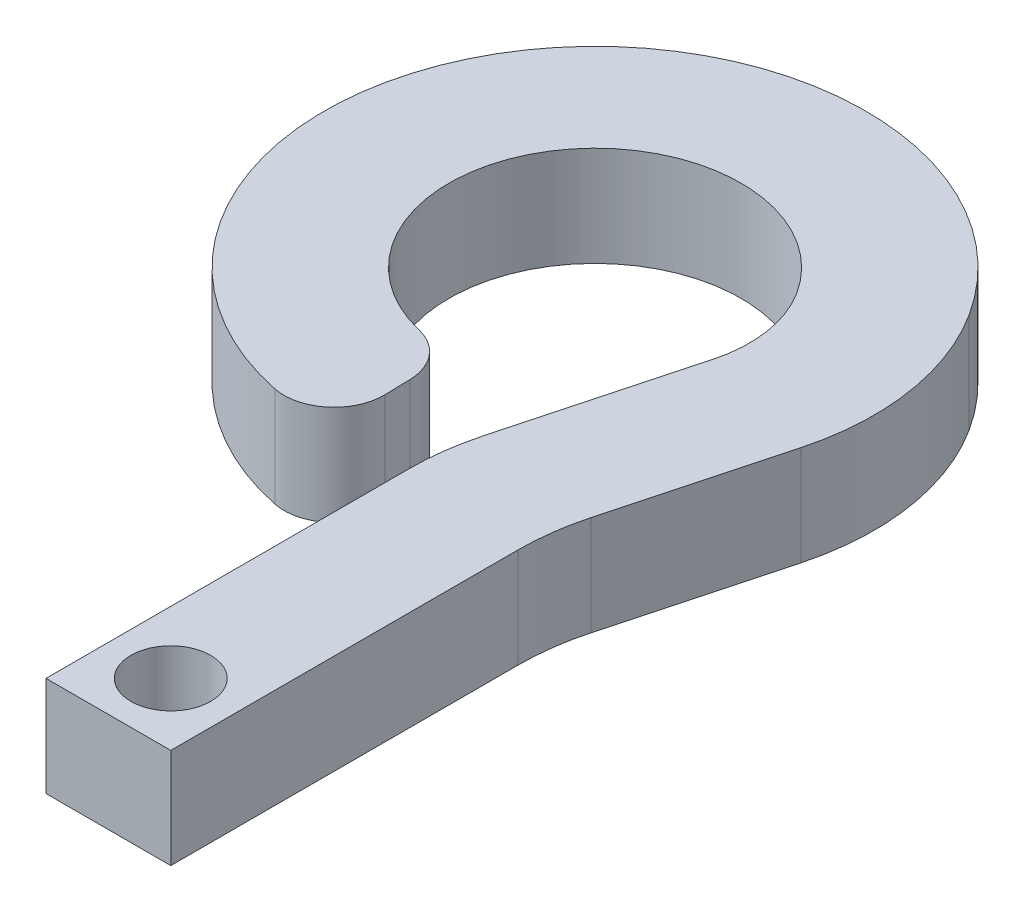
ISO-10303-21;
HEADER;
FILE_DESCRIPTION(('STEP AP214'),'2;1');
FILE_NAME('part.step','',(''),(''),'','','');
FILE_SCHEMA(('AUTOMOTIVE_DESIGN { 1 0 10303 214 1 1 1 1 }'));
ENDSEC;
DATA;
#1=APPLICATION_CONTEXT('core data for automotive mechanical design processes');
#2=APPLICATION_PROTOCOL_DEFINITION('international standard','automotive_design',2000,#1);
#3=PRODUCT_CONTEXT('',#1,'mechanical');
#4=PRODUCT('Part','Part','',(#3));
#5=PRODUCT_RELATED_PRODUCT_CATEGORY('part','',(#4));
#6=PRODUCT_DEFINITION_FORMATION('','',#4);
#7=PRODUCT_DEFINITION_CONTEXT('part definition',#1,'design');
#8=PRODUCT_DEFINITION('design','',#6,#7);
#9=PRODUCT_DEFINITION_SHAPE('','',#8);
#10=(LENGTH_UNIT() NAMED_UNIT(*) SI_UNIT(.MILLI.,.METRE.));
#11=(NAMED_UNIT(*) PLANE_ANGLE_UNIT() SI_UNIT($,.RADIAN.));
#12=(NAMED_UNIT(*) SI_UNIT($,.STERADIAN.) SOLID_ANGLE_UNIT());
#13=UNCERTAINTY_MEASURE_WITH_UNIT(LENGTH_MEASURE(1.E-05),#10,'distance_accuracy_value','');
#14=(GEOMETRIC_REPRESENTATION_CONTEXT(3) GLOBAL_UNCERTAINTY_ASSIGNED_CONTEXT((#13)) GLOBAL_UNIT_ASSIGNED_CONTEXT((#10,
#11,#12)) REPRESENTATION_CONTEXT('',''));
#15=CARTESIAN_POINT('',(0.,0.,0.));
#16=DIRECTION('',(0.,0.,1.));
#17=DIRECTION('',(1.,0.,0.));
#18=AXIS2_PLACEMENT_3D('',#15,#16,#17);
#19=CARTESIAN_POINT('',(0.,-4.,0.));
#20=DIRECTION('',(1.,0.,0.));
#21=DIRECTION('',(0.,0.,-1.));
#22=AXIS2_PLACEMENT_3D('',#19,#20,#21);
#23=PLANE('',#22);
#24=DIRECTION('',(0.,0.,-1.));
#25=VECTOR('',#24,1.);
#26=CARTESIAN_POINT('',(0.,0.,0.));
#27=LINE('',#26,#25);
#28=CARTESIAN_POINT('',(0.,0.,0.));
#29=VERTEX_POINT('',#28);
#30=CARTESIAN_POINT('',(0.,0.,-13.908964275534));
#31=VERTEX_POINT('',#30);
#32=EDGE_CURVE('E184',#29,#31,#27,.T.);
#33=ORIENTED_EDGE('',*,*,#32,.F.);
#34=DIRECTION('',(0.,1.,0.));
#35=VECTOR('',#34,1.);
#36=CARTESIAN_POINT('',(0.,-4.,0.));
#37=LINE('',#36,#35);
#38=CARTESIAN_POINT('',(0.,-4.,0.));
#39=VERTEX_POINT('',#38);
#40=EDGE_CURVE('E156',#39,#29,#37,.T.);
#41=ORIENTED_EDGE('',*,*,#40,.F.);
#42=DIRECTION('',(0.,0.,-1.));
#43=VECTOR('',#42,1.);
#44=CARTESIAN_POINT('',(0.,-4.,0.));
#45=LINE('',#44,#43);
#46=CARTESIAN_POINT('',(0.,-4.,-13.908964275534));
#47=VERTEX_POINT('',#46);
#48=EDGE_CURVE('E151',#39,#47,#45,.T.);
#49=ORIENTED_EDGE('',*,*,#48,.T.);
#50=DIRECTION('',(0.,1.,0.));
#51=VECTOR('',#50,1.);
#52=CARTESIAN_POINT('',(0.,-4.,-13.908964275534));
#53=LINE('',#52,#51);
#54=EDGE_CURVE('E133',#47,#31,#53,.T.);
#55=ORIENTED_EDGE('',*,*,#54,.T.);
#56=EDGE_LOOP('',(#33,#41,#49,#55));
#57=FACE_BOUND('',#56,.T.);
#58=ADVANCED_FACE('F34',(#57),#23,.T.);
#59=CARTESIAN_POINT('',(0.,-4.,0.));
#60=DIRECTION('',(0.,0.,1.));
#61=DIRECTION('',(1.,0.,0.));
#62=AXIS2_PLACEMENT_3D('',#59,#60,#61);
#63=PLANE('',#62);
#64=DIRECTION('',(1.,0.,0.));
#65=VECTOR('',#64,1.);
#66=CARTESIAN_POINT('',(0.,0.,0.));
#67=LINE('',#66,#65);
#68=CARTESIAN_POINT('',(-5.,0.,0.));
#69=VERTEX_POINT('',#68);
#70=EDGE_CURVE('E157',#69,#29,#67,.T.);
#71=ORIENTED_EDGE('',*,*,#70,.F.);
#72=DIRECTION('',(0.,1.,0.));
#73=VECTOR('',#72,1.);
#74=CARTESIAN_POINT('',(-5.,-4.,0.));
#75=LINE('',#74,#73);
#76=CARTESIAN_POINT('',(-5.,-4.,0.));
#77=VERTEX_POINT('',#76);
#78=EDGE_CURVE('E206',#77,#69,#75,.T.);
#79=ORIENTED_EDGE('',*,*,#78,.F.);
#80=DIRECTION('',(1.,0.,0.));
#81=VECTOR('',#80,1.);
#82=CARTESIAN_POINT('',(0.,-4.,0.));
#83=LINE('',#82,#81);
#84=EDGE_CURVE('E144',#77,#39,#83,.T.);
#85=ORIENTED_EDGE('',*,*,#84,.T.);
#86=ORIENTED_EDGE('',*,*,#40,.T.);
#87=EDGE_LOOP('',(#71,#79,#85,#86));
#88=FACE_BOUND('',#87,.T.);
#89=ADVANCED_FACE('F254',(#88),#63,.T.);
#90=CARTESIAN_POINT('',(-5.,-4.,0.));
#91=DIRECTION('',(-1.,0.,0.));
#92=DIRECTION('',(0.,0.,1.));
#93=AXIS2_PLACEMENT_3D('',#90,#91,#92);
#94=PLANE('',#93);
#95=DIRECTION('',(0.,0.,1.));
#96=VECTOR('',#95,1.);
#97=CARTESIAN_POINT('',(-5.,0.,0.));
#98=LINE('',#97,#96);
#99=CARTESIAN_POINT('',(-5.,0.,-14.567226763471));
#100=VERTEX_POINT('',#99);
#101=EDGE_CURVE('E160',#100,#69,#98,.T.);
#102=ORIENTED_EDGE('',*,*,#101,.F.);
#103=DIRECTION('',(0.,1.,0.));
#104=VECTOR('',#103,1.);
#105=CARTESIAN_POINT('',(-5.,-4.,-14.567226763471));
#106=LINE('',#105,#104);
#107=CARTESIAN_POINT('',(-5.,-4.,-14.567226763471));
#108=VERTEX_POINT('',#107);
#109=EDGE_CURVE('E208',#108,#100,#106,.T.);
#110=ORIENTED_EDGE('',*,*,#109,.F.);
#111=DIRECTION('',(0.,0.,1.));
#112=VECTOR('',#111,1.);
#113=CARTESIAN_POINT('',(-5.,-4.,0.));
#114=LINE('',#113,#112);
#115=EDGE_CURVE('E180',#108,#77,#114,.T.);
#116=ORIENTED_EDGE('',*,*,#115,.T.);
#117=ORIENTED_EDGE('',*,*,#78,.T.);
#118=EDGE_LOOP('',(#102,#110,#116,#117));
#119=FACE_BOUND('',#118,.T.);
#120=ADVANCED_FACE('F304',(#119),#94,.T.);
#121=CARTESIAN_POINT('',(5.,-4.,-14.567226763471));
#122=DIRECTION('',(0.,1.,0.));
#123=DIRECTION('',(0.,0.,1.));
#124=AXIS2_PLACEMENT_3D('',#121,#122,#123);
#125=CYLINDRICAL_SURFACE('',#124,10.);
#126=CARTESIAN_POINT('',(5.,0.,-14.567226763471));
#127=DIRECTION('',(0.,1.,0.));
#128=DIRECTION('',(0.,0.,-1.));
#129=AXIS2_PLACEMENT_3D('',#126,#127,#128);
#130=CIRCLE('',#129,10.);
#131=CARTESIAN_POINT('',(-4.65925826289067,0.,-17.1554172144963));
#132=VERTEX_POINT('',#131);
#133=EDGE_CURVE('E199',#132,#100,#130,.T.);
#134=ORIENTED_EDGE('',*,*,#133,.F.);
#135=DIRECTION('',(0.,1.,0.));
#136=VECTOR('',#135,1.);
#137=CARTESIAN_POINT('',(-4.65925826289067,-4.,-17.1554172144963));
#138=LINE('',#137,#136);
#139=CARTESIAN_POINT('',(-4.65925826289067,-4.,-17.1554172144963));
#140=VERTEX_POINT('',#139);
#141=EDGE_CURVE('E210',#140,#132,#138,.T.);
#142=ORIENTED_EDGE('',*,*,#141,.F.);
#143=CARTESIAN_POINT('',(5.,-4.,-14.567226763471));
#144=DIRECTION('',(0.,1.,0.));
#145=DIRECTION('',(0.,0.,-1.));
#146=AXIS2_PLACEMENT_3D('',#143,#144,#145);
#147=CIRCLE('',#146,10.);
#148=EDGE_CURVE('E177',#140,#108,#147,.T.);
#149=ORIENTED_EDGE('',*,*,#148,.T.);
#150=ORIENTED_EDGE('',*,*,#109,.T.);
#151=EDGE_LOOP('',(#134,#142,#149,#150));
#152=FACE_BOUND('',#151,.T.);
#153=ADVANCED_FACE('F262',(#152),#125,.T.);
#154=CARTESIAN_POINT('',(-4.65925826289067,-4.,-17.1554172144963));
#155=DIRECTION('',(-0.965925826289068,0.,-0.258819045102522));
#156=DIRECTION('',(-0.258819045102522,0.,0.965925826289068));
#157=AXIS2_PLACEMENT_3D('',#154,#155,#156);
#158=PLANE('',#157);
#159=DIRECTION('',(-0.258819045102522,0.,0.965925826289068));
#160=VECTOR('',#159,1.);
#161=CARTESIAN_POINT('',(-4.65925826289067,0.,-17.1554172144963));
#162=LINE('',#161,#160);
#163=CARTESIAN_POINT('',(-2.70994743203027,0.,-24.4303442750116));
#164=VERTEX_POINT('',#163);
#165=EDGE_CURVE('E197',#164,#132,#162,.T.);
#166=ORIENTED_EDGE('',*,*,#165,.F.);
#167=DIRECTION('',(0.,-1.,0.));
#168=VECTOR('',#167,1.);
#169=CARTESIAN_POINT('',(-2.70994743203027,-4.,-24.4303442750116));
#170=LINE('',#169,#168);
#171=CARTESIAN_POINT('',(-2.70994743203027,-4.,-24.4303442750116));
#172=VERTEX_POINT('',#171);
#173=EDGE_CURVE('E235',#164,#172,#170,.T.);
#174=ORIENTED_EDGE('',*,*,#173,.T.);
#175=DIRECTION('',(-0.258819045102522,0.,0.965925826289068));
#176=VECTOR('',#175,1.);
#177=CARTESIAN_POINT('',(-4.65925826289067,-4.,-17.1554172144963));
#178=LINE('',#177,#176);
#179=EDGE_CURVE('E175',#172,#140,#178,.T.);
#180=ORIENTED_EDGE('',*,*,#179,.T.);
#181=ORIENTED_EDGE('',*,*,#141,.T.);
#182=EDGE_LOOP('',(#166,#174,#180,#181));
#183=FACE_BOUND('',#182,.T.);
#184=ADVANCED_FACE('F265',(#183),#158,.T.);
#185=CARTESIAN_POINT('',(-8.26003794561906,-4.,-25.2642967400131));
#186=DIRECTION('',(0.,1.,0.));
#187=DIRECTION('',(0.,0.,1.));
#188=AXIS2_PLACEMENT_3D('',#185,#186,#187);
#189=CYLINDRICAL_SURFACE('',#188,5.85486604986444);
#190=CARTESIAN_POINT('',(-8.26003794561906,-4.,-25.2642967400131));
#191=DIRECTION('',(0.,-1.,0.));
#192=DIRECTION('',(0.,0.,-1.));
#193=AXIS2_PLACEMENT_3D('',#190,#191,#192);
#194=CIRCLE('',#193,5.85486604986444);
#195=CARTESIAN_POINT('',(-9.61473586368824,-4.,-19.5683113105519));
#196=VERTEX_POINT('',#195);
#197=CARTESIAN_POINT('',(-3.32569193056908,-4.,-28.4157544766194));
#198=VERTEX_POINT('',#197);
#199=EDGE_CURVE('E172',#196,#198,#194,.T.);
#200=ORIENTED_EDGE('',*,*,#199,.T.);
#201=DIRECTION('',(0.,1.,0.));
#202=VECTOR('',#201,1.);
#203=CARTESIAN_POINT('',(-3.32569193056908,-4.,-28.4157544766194));
#204=LINE('',#203,#202);
#205=CARTESIAN_POINT('',(-3.32569193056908,0.,-28.4157544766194));
#206=VERTEX_POINT('',#205);
#207=EDGE_CURVE('E232',#198,#206,#204,.T.);
#208=ORIENTED_EDGE('',*,*,#207,.T.);
#209=CARTESIAN_POINT('',(-8.26003794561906,0.,-25.2642967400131));
#210=DIRECTION('',(0.,-1.,0.));
#211=DIRECTION('',(0.,0.,-1.));
#212=AXIS2_PLACEMENT_3D('',#209,#210,#211);
#213=CIRCLE('',#212,5.85486604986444);
#214=CARTESIAN_POINT('',(-9.61473586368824,0.,-19.5683113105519));
#215=VERTEX_POINT('',#214);
#216=EDGE_CURVE('E194',#215,#206,#213,.T.);
#217=ORIENTED_EDGE('',*,*,#216,.F.);
#218=DIRECTION('',(0.,1.,0.));
#219=VECTOR('',#218,1.);
#220=CARTESIAN_POINT('',(-9.61473586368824,-4.,-19.5683113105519));
#221=LINE('',#220,#219);
#222=EDGE_CURVE('E230',#215,#196,#221,.F.);
#223=ORIENTED_EDGE('',*,*,#222,.T.);
#224=EDGE_LOOP('',(#200,#208,#217,#223));
#225=FACE_BOUND('',#224,.T.);
#226=ADVANCED_FACE('F274',(#225),#189,.F.);
#227=CARTESIAN_POINT('',(-8.11977943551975,-4.,-19.4111109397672));
#228=DIRECTION('',(0.999713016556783,0.,-0.0239558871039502));
#229=DIRECTION('',(-0.0239558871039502,0.,-0.999713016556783));
#230=AXIS2_PLACEMENT_3D('',#227,#228,#229);
#231=PLANE('',#230);
#232=DIRECTION('',(-0.0239558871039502,0.,-0.999713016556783));
#233=VECTOR('',#232,1.);
#234=CARTESIAN_POINT('',(-8.11977943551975,0.,-19.4111109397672));
#235=LINE('',#234,#233);
#236=CARTESIAN_POINT('',(-8.05339338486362,0.,-16.6407272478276));
#237=VERTEX_POINT('',#236);
#238=CARTESIAN_POINT('',(-8.07806949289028,0.,-17.6704961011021));
#239=VERTEX_POINT('',#238);
#240=EDGE_CURVE('E191',#237,#239,#235,.T.);
#241=ORIENTED_EDGE('',*,*,#240,.F.);
#242=DIRECTION('',(0.,1.,0.));
#243=VECTOR('',#242,1.);
#244=CARTESIAN_POINT('',(-8.05339338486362,-4.,-16.6407272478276));
#245=LINE('',#244,#243);
#246=CARTESIAN_POINT('',(-8.05339338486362,-4.,-16.6407272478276));
#247=VERTEX_POINT('',#246);
#248=EDGE_CURVE('E223',#237,#247,#245,.F.);
#249=ORIENTED_EDGE('',*,*,#248,.T.);
#250=DIRECTION('',(-0.0239558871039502,0.,-0.999713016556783));
#251=VECTOR('',#250,1.);
#252=CARTESIAN_POINT('',(-8.11977943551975,-4.,-19.4111109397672));
#253=LINE('',#252,#251);
#254=CARTESIAN_POINT('',(-8.07806949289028,-4.,-17.6704961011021));
#255=VERTEX_POINT('',#254);
#256=EDGE_CURVE('E169',#247,#255,#253,.T.);
#257=ORIENTED_EDGE('',*,*,#256,.T.);
#258=DIRECTION('',(0.,1.,0.));
#259=VECTOR('',#258,1.);
#260=CARTESIAN_POINT('',(-8.07806949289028,-4.,-17.6704961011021));
#261=LINE('',#260,#259);
#262=EDGE_CURVE('E220',#255,#239,#261,.T.);
#263=ORIENTED_EDGE('',*,*,#262,.T.);
#264=EDGE_LOOP('',(#241,#249,#257,#263));
#265=FACE_BOUND('',#264,.T.);
#266=ADVANCED_FACE('F282',(#265),#231,.T.);
#267=CARTESIAN_POINT('',(-8.26003794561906,-4.,-25.2642967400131));
#268=DIRECTION('',(0.,1.,0.));
#269=DIRECTION('',(0.,0.,1.));
#270=AXIS2_PLACEMENT_3D('',#267,#268,#269);
#271=CYLINDRICAL_SURFACE('',#270,10.8548660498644);
#272=CARTESIAN_POINT('',(-8.26003794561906,0.,-25.2642967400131));
#273=DIRECTION('',(0.,1.,0.));
#274=DIRECTION('',(0.,0.,-1.));
#275=AXIS2_PLACEMENT_3D('',#272,#273,#274);
#276=CIRCLE('',#275,10.8548660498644);
#277=CARTESIAN_POINT('',(0.888192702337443,0.,-31.1070694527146));
#278=VERTEX_POINT('',#277);
#279=CARTESIAN_POINT('',(-10.4577451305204,0.,-14.6342355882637));
#280=VERTEX_POINT('',#279);
#281=EDGE_CURVE('E189',#278,#280,#276,.T.);
#282=ORIENTED_EDGE('',*,*,#281,.F.);
#283=DIRECTION('',(0.,1.,0.));
#284=VECTOR('',#283,1.);
#285=CARTESIAN_POINT('',(0.888192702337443,-4.,-31.1070694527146));
#286=LINE('',#285,#284);
#287=CARTESIAN_POINT('',(0.888192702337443,-4.,-31.1070694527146));
#288=VERTEX_POINT('',#287);
#289=EDGE_CURVE('E42',#278,#288,#286,.F.);
#290=ORIENTED_EDGE('',*,*,#289,.T.);
#291=CARTESIAN_POINT('',(-8.26003794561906,-4.,-25.2642967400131));
#292=DIRECTION('',(0.,1.,0.));
#293=DIRECTION('',(0.,0.,-1.));
#294=AXIS2_PLACEMENT_3D('',#291,#292,#293);
#295=CIRCLE('',#294,10.8548660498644);
#296=CARTESIAN_POINT('',(-10.4577451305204,-4.,-14.6342355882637));
#297=VERTEX_POINT('',#296);
#298=EDGE_CURVE('E167',#288,#297,#295,.T.);
#299=ORIENTED_EDGE('',*,*,#298,.T.);
#300=DIRECTION('',(0.,1.,0.));
#301=VECTOR('',#300,1.);
#302=CARTESIAN_POINT('',(-10.4577451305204,-4.,-14.6342355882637));
#303=LINE('',#302,#301);
#304=EDGE_CURVE('E205',#297,#280,#303,.T.);
#305=ORIENTED_EDGE('',*,*,#304,.T.);
#306=EDGE_LOOP('',(#282,#290,#299,#305));
#307=FACE_BOUND('',#306,.T.);
#308=ADVANCED_FACE('F290',(#307),#271,.T.);
#309=CARTESIAN_POINT('',(0.340741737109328,-4.,-16.4971547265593));
#310=DIRECTION('',(0.965925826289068,0.,0.258819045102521));
#311=DIRECTION('',(0.258819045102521,0.,-0.965925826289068));
#312=AXIS2_PLACEMENT_3D('',#309,#310,#311);
#313=PLANE('',#312);
#314=DIRECTION('',(0.258819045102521,0.,-0.965925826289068));
#315=VECTOR('',#314,1.);
#316=CARTESIAN_POINT('',(0.340741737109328,-4.,-16.4971547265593));
#317=LINE('',#316,#315);
#318=CARTESIAN_POINT('',(0.340741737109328,-4.,-16.4971547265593));
#319=VERTEX_POINT('',#318);
#320=CARTESIAN_POINT('',(2.11968169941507,-4.,-23.136249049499));
#321=VERTEX_POINT('',#320);
#322=EDGE_CURVE('E154',#319,#321,#317,.T.);
#323=ORIENTED_EDGE('',*,*,#322,.T.);
#324=DIRECTION('',(0.,1.,0.));
#325=VECTOR('',#324,1.);
#326=CARTESIAN_POINT('',(2.11968169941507,-4.,-23.136249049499));
#327=LINE('',#326,#325);
#328=CARTESIAN_POINT('',(2.11968169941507,0.,-23.136249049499));
#329=VERTEX_POINT('',#328);
#330=EDGE_CURVE('E241',#321,#329,#327,.T.);
#331=ORIENTED_EDGE('',*,*,#330,.T.);
#332=DIRECTION('',(0.258819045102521,0.,-0.965925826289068));
#333=VECTOR('',#332,1.);
#334=CARTESIAN_POINT('',(0.340741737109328,0.,-16.4971547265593));
#335=LINE('',#334,#333);
#336=CARTESIAN_POINT('',(0.340741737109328,0.,-16.4971547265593));
#337=VERTEX_POINT('',#336);
#338=EDGE_CURVE('E187',#337,#329,#335,.T.);
#339=ORIENTED_EDGE('',*,*,#338,.F.);
#340=DIRECTION('',(0.,1.,0.));
#341=VECTOR('',#340,1.);
#342=CARTESIAN_POINT('',(0.340741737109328,-4.,-16.4971547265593));
#343=LINE('',#342,#341);
#344=EDGE_CURVE('E143',#319,#337,#343,.T.);
#345=ORIENTED_EDGE('',*,*,#344,.F.);
#346=EDGE_LOOP('',(#323,#331,#339,#345));
#347=FACE_BOUND('',#346,.T.);
#348=ADVANCED_FACE('F247',(#347),#313,.T.);
#349=CARTESIAN_POINT('',(10.,-4.,-13.908964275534));
#350=DIRECTION('',(0.,1.,0.));
#351=DIRECTION('',(0.,0.,1.));
#352=AXIS2_PLACEMENT_3D('',#349,#350,#351);
#353=CYLINDRICAL_SURFACE('',#352,10.);
#354=CARTESIAN_POINT('',(10.,0.,-13.908964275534));
#355=DIRECTION('',(0.,-1.,0.));
#356=DIRECTION('',(0.,0.,-1.));
#357=AXIS2_PLACEMENT_3D('',#354,#355,#356);
#358=CIRCLE('',#357,10.);
#359=EDGE_CURVE('E138',#31,#337,#358,.T.);
#360=ORIENTED_EDGE('',*,*,#359,.F.);
#361=ORIENTED_EDGE('',*,*,#54,.F.);
#362=CARTESIAN_POINT('',(10.,-4.,-13.908964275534));
#363=DIRECTION('',(0.,-1.,0.));
#364=DIRECTION('',(0.,0.,-1.));
#365=AXIS2_PLACEMENT_3D('',#362,#363,#364);
#366=CIRCLE('',#365,10.);
#367=EDGE_CURVE('E136',#47,#319,#366,.T.);
#368=ORIENTED_EDGE('',*,*,#367,.T.);
#369=ORIENTED_EDGE('',*,*,#344,.T.);
#370=EDGE_LOOP('',(#360,#361,#368,#369));
#371=FACE_BOUND('',#370,.T.);
#372=ADVANCED_FACE('F135',(#371),#353,.F.);
#373=CARTESIAN_POINT('',(10.,-4.,-13.908964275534));
#374=DIRECTION('',(0.,-1.,0.));
#375=DIRECTION('',(0.,0.,-1.));
#376=AXIS2_PLACEMENT_3D('',#373,#374,#375);
#377=PLANE('',#376);
#378=CARTESIAN_POINT('',(-2.5,-4.,-2.5));
#379=DIRECTION('',(0.,-1.,0.));
#380=DIRECTION('',(0.,0.,-1.));
#381=AXIS2_PLACEMENT_3D('',#378,#379,#380);
#382=CIRCLE('',#381,1.6);
#383=CARTESIAN_POINT('',(-2.5,-4.,-4.1));
#384=VERTEX_POINT('',#383);
#385=EDGE_CURVE('E163',#384,#384,#382,.T.);
#386=ORIENTED_EDGE('',*,*,#385,.F.);
#387=EDGE_LOOP('',(#386));
#388=FACE_BOUND('',#387,.T.);
#389=ORIENTED_EDGE('',*,*,#298,.F.);
#390=CARTESIAN_POINT('',(-7.53957656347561,-4.,-25.7244395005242));
#391=DIRECTION('',(0.,-1.,0.));
#392=DIRECTION('',(0.,0.,-1.));
#393=AXIS2_PLACEMENT_3D('',#390,#391,#392);
#394=CIRCLE('',#393,10.);
#395=EDGE_CURVE('E11',#288,#321,#394,.T.);
#396=ORIENTED_EDGE('',*,*,#395,.T.);
#397=ORIENTED_EDGE('',*,*,#322,.F.);
#398=ORIENTED_EDGE('',*,*,#367,.F.);
#399=ORIENTED_EDGE('',*,*,#48,.F.);
#400=ORIENTED_EDGE('',*,*,#84,.F.);
#401=ORIENTED_EDGE('',*,*,#115,.F.);
#402=ORIENTED_EDGE('',*,*,#148,.F.);
#403=ORIENTED_EDGE('',*,*,#179,.F.);
#404=CARTESIAN_POINT('',(-7.53957656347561,-4.,-25.7244395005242));
#405=DIRECTION('',(0.,-1.,0.));
#406=DIRECTION('',(0.,0.,-1.));
#407=AXIS2_PLACEMENT_3D('',#404,#405,#406);
#408=CIRCLE('',#407,5.);
#409=EDGE_CURVE('E239',#172,#198,#408,.F.);
#410=ORIENTED_EDGE('',*,*,#409,.T.);
#411=ORIENTED_EDGE('',*,*,#199,.F.);
#412=CARTESIAN_POINT('',(-10.0774955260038,-4.,-17.6225843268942));
#413=DIRECTION('',(0.,-1.,0.));
#414=DIRECTION('',(0.,0.,-1.));
#415=AXIS2_PLACEMENT_3D('',#412,#413,#414);
#416=CIRCLE('',#415,2.);
#417=EDGE_CURVE('E225',#196,#255,#416,.T.);
#418=ORIENTED_EDGE('',*,*,#417,.T.);
#419=ORIENTED_EDGE('',*,*,#256,.F.);
#420=CARTESIAN_POINT('',(-10.0528194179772,-4.,-16.5928154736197));
#421=DIRECTION('',(0.,-1.,0.));
#422=DIRECTION('',(0.,0.,-1.));
#423=AXIS2_PLACEMENT_3D('',#420,#421,#422);
#424=CIRCLE('',#423,2.);
#425=EDGE_CURVE('E227',#247,#297,#424,.T.);
#426=ORIENTED_EDGE('',*,*,#425,.T.);
#427=EDGE_LOOP('',(#389,#396,#397,#398,#399,#400,#401,#402,#403,#410,#411,#418,#419,#426));
#428=FACE_BOUND('',#427,.T.);
#429=ADVANCED_FACE('F149',(#388,#428),#377,.T.);
#430=CARTESIAN_POINT('',(10.,0.,-13.908964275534));
#431=DIRECTION('',(0.,-1.,0.));
#432=DIRECTION('',(0.,0.,-1.));
#433=AXIS2_PLACEMENT_3D('',#430,#431,#432);
#434=PLANE('',#433);
#435=CARTESIAN_POINT('',(-2.5,0.,-2.5));
#436=DIRECTION('',(0.,1.,0.));
#437=DIRECTION('',(0.,0.,1.));
#438=AXIS2_PLACEMENT_3D('',#435,#436,#437);
#439=CIRCLE('',#438,1.6);
#440=CARTESIAN_POINT('',(-2.5,0.,-0.9));
#441=VERTEX_POINT('',#440);
#442=EDGE_CURVE('E458',#441,#441,#439,.T.);
#443=ORIENTED_EDGE('',*,*,#442,.F.);
#444=EDGE_LOOP('',(#443));
#445=FACE_BOUND('',#444,.T.);
#446=ORIENTED_EDGE('',*,*,#338,.T.);
#447=CARTESIAN_POINT('',(-7.53957656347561,0.,-25.7244395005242));
#448=DIRECTION('',(0.,-1.,0.));
#449=DIRECTION('',(0.,0.,-1.));
#450=AXIS2_PLACEMENT_3D('',#447,#448,#449);
#451=CIRCLE('',#450,10.);
#452=EDGE_CURVE('E56',#329,#278,#451,.F.);
#453=ORIENTED_EDGE('',*,*,#452,.T.);
#454=ORIENTED_EDGE('',*,*,#281,.T.);
#455=CARTESIAN_POINT('',(-10.0528194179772,0.,-16.5928154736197));
#456=DIRECTION('',(0.,-1.,0.));
#457=DIRECTION('',(0.,0.,-1.));
#458=AXIS2_PLACEMENT_3D('',#455,#456,#457);
#459=CIRCLE('',#458,2.);
#460=EDGE_CURVE('E218',#280,#237,#459,.F.);
#461=ORIENTED_EDGE('',*,*,#460,.T.);
#462=ORIENTED_EDGE('',*,*,#240,.T.);
#463=CARTESIAN_POINT('',(-10.0774955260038,0.,-17.6225843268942));
#464=DIRECTION('',(0.,-1.,0.));
#465=DIRECTION('',(0.,0.,-1.));
#466=AXIS2_PLACEMENT_3D('',#463,#464,#465);
#467=CIRCLE('',#466,2.);
#468=EDGE_CURVE('E216',#239,#215,#467,.F.);
#469=ORIENTED_EDGE('',*,*,#468,.T.);
#470=ORIENTED_EDGE('',*,*,#216,.T.);
#471=CARTESIAN_POINT('',(-7.53957656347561,0.,-25.7244395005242));
#472=DIRECTION('',(0.,-1.,0.));
#473=DIRECTION('',(0.,0.,-1.));
#474=AXIS2_PLACEMENT_3D('',#471,#472,#473);
#475=CIRCLE('',#474,5.);
#476=EDGE_CURVE('E237',#206,#164,#475,.T.);
#477=ORIENTED_EDGE('',*,*,#476,.T.);
#478=ORIENTED_EDGE('',*,*,#165,.T.);
#479=ORIENTED_EDGE('',*,*,#133,.T.);
#480=ORIENTED_EDGE('',*,*,#101,.T.);
#481=ORIENTED_EDGE('',*,*,#70,.T.);
#482=ORIENTED_EDGE('',*,*,#32,.T.);
#483=ORIENTED_EDGE('',*,*,#359,.T.);
#484=EDGE_LOOP('',(#446,#453,#454,#461,#462,#469,#470,#477,#478,#479,#480,#481,#482,#483));
#485=FACE_BOUND('',#484,.T.);
#486=ADVANCED_FACE('F250',(#445,#485),#434,.F.);
#487=CARTESIAN_POINT('',(-10.0528194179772,-4.,-16.5928154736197));
#488=DIRECTION('',(0.,1.,0.));
#489=DIRECTION('',(0.,0.,1.));
#490=AXIS2_PLACEMENT_3D('',#487,#488,#489);
#491=CYLINDRICAL_SURFACE('',#490,2.);
#492=ORIENTED_EDGE('',*,*,#425,.F.);
#493=ORIENTED_EDGE('',*,*,#248,.F.);
#494=ORIENTED_EDGE('',*,*,#460,.F.);
#495=ORIENTED_EDGE('',*,*,#304,.F.);
#496=EDGE_LOOP('',(#492,#493,#494,#495));
#497=FACE_BOUND('',#496,.T.);
#498=ADVANCED_FACE('F288',(#497),#491,.T.);
#499=CARTESIAN_POINT('',(-10.0774955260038,-4.,-17.6225843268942));
#500=DIRECTION('',(0.,1.,0.));
#501=DIRECTION('',(0.,0.,1.));
#502=AXIS2_PLACEMENT_3D('',#499,#500,#501);
#503=CYLINDRICAL_SURFACE('',#502,2.);
#504=ORIENTED_EDGE('',*,*,#417,.F.);
#505=ORIENTED_EDGE('',*,*,#222,.F.);
#506=ORIENTED_EDGE('',*,*,#468,.F.);
#507=ORIENTED_EDGE('',*,*,#262,.F.);
#508=EDGE_LOOP('',(#504,#505,#506,#507));
#509=FACE_BOUND('',#508,.T.);
#510=ADVANCED_FACE('F280',(#509),#503,.T.);
#511=CARTESIAN_POINT('',(-7.53957656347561,-4.,-25.7244395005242));
#512=DIRECTION('',(0.,1.,0.));
#513=DIRECTION('',(0.,0.,1.));
#514=AXIS2_PLACEMENT_3D('',#511,#512,#513);
#515=CYLINDRICAL_SURFACE('',#514,5.);
#516=ORIENTED_EDGE('',*,*,#409,.F.);
#517=ORIENTED_EDGE('',*,*,#173,.F.);
#518=ORIENTED_EDGE('',*,*,#476,.F.);
#519=ORIENTED_EDGE('',*,*,#207,.F.);
#520=EDGE_LOOP('',(#516,#517,#518,#519));
#521=FACE_BOUND('',#520,.T.);
#522=ADVANCED_FACE('F271',(#521),#515,.F.);
#523=CARTESIAN_POINT('',(-7.53957656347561,-4.,-25.7244395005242));
#524=DIRECTION('',(0.,1.,0.));
#525=DIRECTION('',(0.,0.,1.));
#526=AXIS2_PLACEMENT_3D('',#523,#524,#525);
#527=CYLINDRICAL_SURFACE('',#526,10.);
#528=ORIENTED_EDGE('',*,*,#395,.F.);
#529=ORIENTED_EDGE('',*,*,#289,.F.);
#530=ORIENTED_EDGE('',*,*,#452,.F.);
#531=ORIENTED_EDGE('',*,*,#330,.F.);
#532=EDGE_LOOP('',(#528,#529,#530,#531));
#533=FACE_BOUND('',#532,.T.);
#534=ADVANCED_FACE('F36',(#533),#527,.T.);
#535=CARTESIAN_POINT('',(-2.5,-10.,-2.5));
#536=DIRECTION('',(0.,1.,0.));
#537=DIRECTION('',(0.,0.,1.));
#538=AXIS2_PLACEMENT_3D('',#535,#536,#537);
#539=CYLINDRICAL_SURFACE('',#538,1.6);
#540=ORIENTED_EDGE('',*,*,#385,.T.);
#541=EDGE_LOOP('',(#540));
#542=FACE_BOUND('',#541,.T.);
#543=ORIENTED_EDGE('',*,*,#442,.T.);
#544=EDGE_LOOP('',(#543));
#545=FACE_BOUND('',#544,.T.);
#546=ADVANCED_FACE('F292',(#542,#545),#539,.F.);
#547=CLOSED_SHELL('',(#58,#89,#120,#153,#184,#226,#266,#308,#348,#372,#429,#486,#498,#510,#522,
#534,#546));
#548=MANIFOLD_SOLID_BREP('B2',#547);
#549=ADVANCED_BREP_SHAPE_REPRESENTATION('',(#18,#548),#14);
#550=SHAPE_DEFINITION_REPRESENTATION(#9,#549);
ENDSEC;
END-ISO-10303-21;
